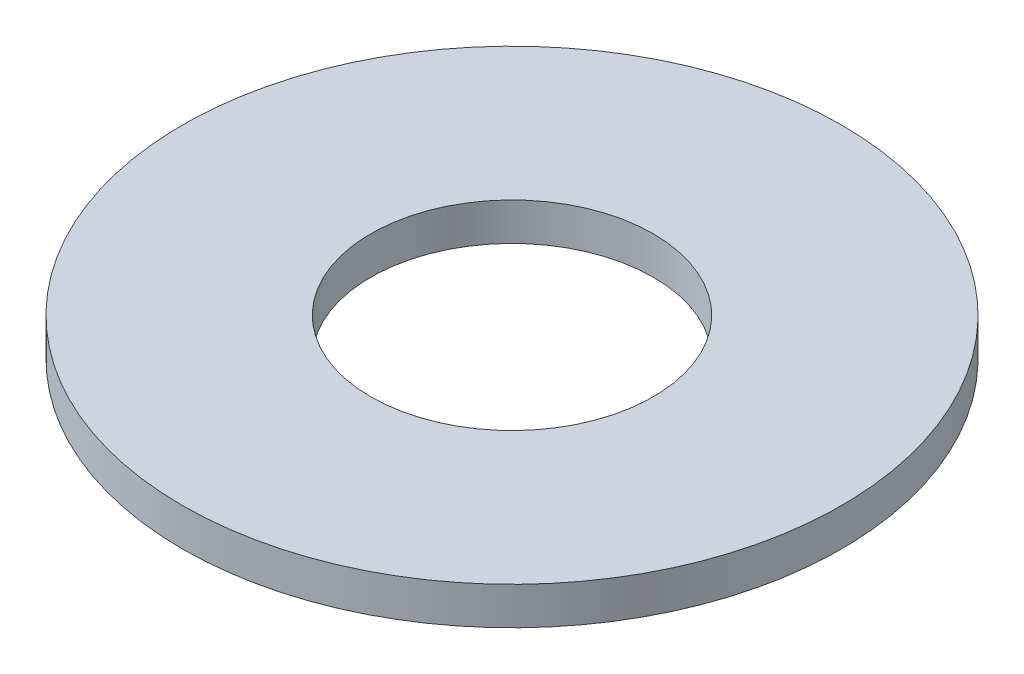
from build123d import *

# Parameters (mm, degrees)
SKETCH1_R           = 22.225
SKETCH1_R_2         = 9.525
BOSS_EXTRUDE1_DEPTH = 2.54


with BuildPart() as part:
    # Sketch1 → Boss-Extrude1 (new body)
    with BuildSketch(Plane(origin=(0, 0, 0), x_dir=(1, 0, 0), z_dir=(0, 1, 0))):
        with Locations(Location((0, 0, 0), (0, 0, 270))):
            Circle(SKETCH1_R)
        with Locations(Location((0, 0, 0), (0, 0, 270))):
            Circle(SKETCH1_R_2, mode=Mode.SUBTRACT)
    extrude(amount=BOSS_EXTRUDE1_DEPTH)


solid = part.part
